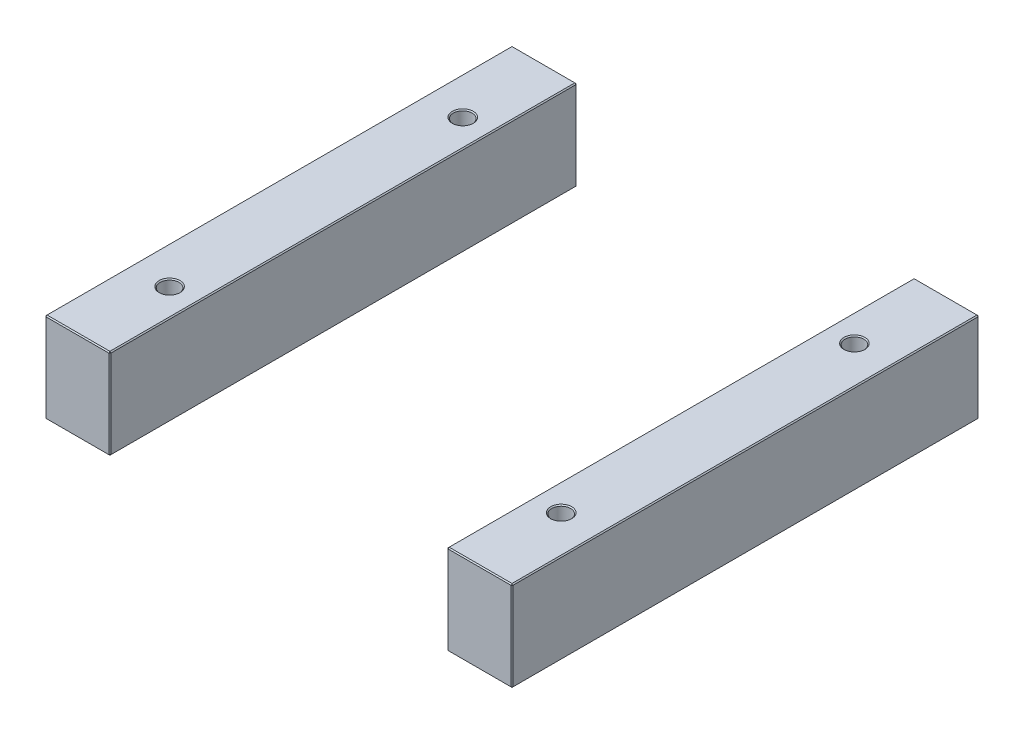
ISO-10303-21;
HEADER;
FILE_DESCRIPTION(('STEP AP214'),'2;1');
FILE_NAME('part.step','',(''),(''),'','','');
FILE_SCHEMA(('AUTOMOTIVE_DESIGN { 1 0 10303 214 1 1 1 1 }'));
ENDSEC;
DATA;
#1=APPLICATION_CONTEXT('core data for automotive mechanical design processes');
#2=APPLICATION_PROTOCOL_DEFINITION('international standard','automotive_design',2000,#1);
#3=PRODUCT_CONTEXT('',#1,'mechanical');
#4=PRODUCT('Part','Part','',(#3));
#5=PRODUCT_RELATED_PRODUCT_CATEGORY('part','',(#4));
#6=PRODUCT_DEFINITION_FORMATION('','',#4);
#7=PRODUCT_DEFINITION_CONTEXT('part definition',#1,'design');
#8=PRODUCT_DEFINITION('design','',#6,#7);
#9=PRODUCT_DEFINITION_SHAPE('','',#8);
#10=(LENGTH_UNIT() NAMED_UNIT(*) SI_UNIT(.MILLI.,.METRE.));
#11=(NAMED_UNIT(*) PLANE_ANGLE_UNIT() SI_UNIT($,.RADIAN.));
#12=(NAMED_UNIT(*) SI_UNIT($,.STERADIAN.) SOLID_ANGLE_UNIT());
#13=UNCERTAINTY_MEASURE_WITH_UNIT(LENGTH_MEASURE(1.E-05),#10,'distance_accuracy_value','');
#14=(GEOMETRIC_REPRESENTATION_CONTEXT(3) GLOBAL_UNCERTAINTY_ASSIGNED_CONTEXT((#13)) GLOBAL_UNIT_ASSIGNED_CONTEXT((#10,
#11,#12)) REPRESENTATION_CONTEXT('',''));
#15=CARTESIAN_POINT('',(0.,0.,0.));
#16=DIRECTION('',(0.,0.,1.));
#17=DIRECTION('',(1.,0.,0.));
#18=AXIS2_PLACEMENT_3D('',#15,#16,#17);
#19=CARTESIAN_POINT('',(-223.,86.,-223.));
#20=DIRECTION('',(0.,0.,1.));
#21=DIRECTION('',(1.,0.,0.));
#22=AXIS2_PLACEMENT_3D('',#19,#20,#21);
#23=PLANE('',#22);
#24=DIRECTION('',(-1.,0.,0.));
#25=VECTOR('',#24,1.);
#26=CARTESIAN_POINT('',(-223.,1.00000000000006,-223.));
#27=LINE('',#26,#25);
#28=CARTESIAN_POINT('',(-162.,1.00000000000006,-223.));
#29=VERTEX_POINT('',#28);
#30=CARTESIAN_POINT('',(-222.,1.00000000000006,-223.));
#31=VERTEX_POINT('',#30);
#32=EDGE_CURVE('P0_E137',#29,#31,#27,.T.);
#33=ORIENTED_EDGE('',*,*,#32,.T.);
#34=DIRECTION('',(0.,1.,0.));
#35=VECTOR('',#34,1.);
#36=CARTESIAN_POINT('',(-222.,86.,-223.));
#37=LINE('',#36,#35);
#38=CARTESIAN_POINT('',(-222.,85.,-223.));
#39=VERTEX_POINT('',#38);
#40=EDGE_CURVE('P0_E235',#31,#39,#37,.T.);
#41=ORIENTED_EDGE('',*,*,#40,.T.);
#42=DIRECTION('',(1.,0.,0.));
#43=VECTOR('',#42,1.);
#44=CARTESIAN_POINT('',(-223.,85.,-223.));
#45=LINE('',#44,#43);
#46=CARTESIAN_POINT('',(-162.,85.,-223.));
#47=VERTEX_POINT('',#46);
#48=EDGE_CURVE('P0_E233',#39,#47,#45,.T.);
#49=ORIENTED_EDGE('',*,*,#48,.T.);
#50=DIRECTION('',(0.,-1.,0.));
#51=VECTOR('',#50,1.);
#52=CARTESIAN_POINT('',(-162.,86.,-223.));
#53=LINE('',#52,#51);
#54=EDGE_CURVE('P0_E230',#47,#29,#53,.T.);
#55=ORIENTED_EDGE('',*,*,#54,.T.);
#56=EDGE_LOOP('',(#33,#41,#49,#55));
#57=FACE_BOUND('',#56,.T.);
#58=ADVANCED_FACE('P0_F16',(#57),#23,.F.);
#59=CARTESIAN_POINT('',(-223.,86.,223.));
#60=DIRECTION('',(1.,0.,0.));
#61=DIRECTION('',(0.,0.,-1.));
#62=AXIS2_PLACEMENT_3D('',#59,#60,#61);
#63=PLANE('',#62);
#64=DIRECTION('',(0.,1.,0.));
#65=VECTOR('',#64,1.);
#66=CARTESIAN_POINT('',(-223.,86.,222.));
#67=LINE('',#66,#65);
#68=CARTESIAN_POINT('',(-223.,1.00000000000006,222.));
#69=VERTEX_POINT('',#68);
#70=CARTESIAN_POINT('',(-223.,85.,222.));
#71=VERTEX_POINT('',#70);
#72=EDGE_CURVE('P0_E217',#69,#71,#67,.T.);
#73=ORIENTED_EDGE('',*,*,#72,.T.);
#74=DIRECTION('',(0.,0.,-1.));
#75=VECTOR('',#74,1.);
#76=CARTESIAN_POINT('',(-223.,85.,223.));
#77=LINE('',#76,#75);
#78=CARTESIAN_POINT('',(-223.,85.,-222.));
#79=VERTEX_POINT('',#78);
#80=EDGE_CURVE('P0_E228',#71,#79,#77,.T.);
#81=ORIENTED_EDGE('',*,*,#80,.T.);
#82=DIRECTION('',(0.,-1.,0.));
#83=VECTOR('',#82,1.);
#84=CARTESIAN_POINT('',(-223.,86.,-222.));
#85=LINE('',#84,#83);
#86=CARTESIAN_POINT('',(-223.,1.00000000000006,-222.));
#87=VERTEX_POINT('',#86);
#88=EDGE_CURVE('P0_E225',#79,#87,#85,.T.);
#89=ORIENTED_EDGE('',*,*,#88,.T.);
#90=DIRECTION('',(0.,0.,1.));
#91=VECTOR('',#90,1.);
#92=CARTESIAN_POINT('',(-223.,1.00000000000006,223.));
#93=LINE('',#92,#91);
#94=EDGE_CURVE('P0_E214',#87,#69,#93,.T.);
#95=ORIENTED_EDGE('',*,*,#94,.T.);
#96=EDGE_LOOP('',(#73,#81,#89,#95));
#97=FACE_BOUND('',#96,.T.);
#98=ADVANCED_FACE('P0_F302',(#97),#63,.F.);
#99=CARTESIAN_POINT('',(-223.,86.,223.));
#100=DIRECTION('',(0.,0.,-1.));
#101=DIRECTION('',(-1.,0.,0.));
#102=AXIS2_PLACEMENT_3D('',#99,#100,#101);
#103=PLANE('',#102);
#104=DIRECTION('',(-1.,0.,0.));
#105=VECTOR('',#104,1.);
#106=CARTESIAN_POINT('',(-223.,85.,223.));
#107=LINE('',#106,#105);
#108=CARTESIAN_POINT('',(-162.,85.,223.));
#109=VERTEX_POINT('',#108);
#110=CARTESIAN_POINT('',(-222.,85.,223.));
#111=VERTEX_POINT('',#110);
#112=EDGE_CURVE('P0_E242',#109,#111,#107,.T.);
#113=ORIENTED_EDGE('',*,*,#112,.T.);
#114=DIRECTION('',(0.,-1.,0.));
#115=VECTOR('',#114,1.);
#116=CARTESIAN_POINT('',(-222.,86.,223.));
#117=LINE('',#116,#115);
#118=CARTESIAN_POINT('',(-222.,1.00000000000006,223.));
#119=VERTEX_POINT('',#118);
#120=EDGE_CURVE('P0_E244',#111,#119,#117,.T.);
#121=ORIENTED_EDGE('',*,*,#120,.T.);
#122=DIRECTION('',(1.,0.,0.));
#123=VECTOR('',#122,1.);
#124=CARTESIAN_POINT('',(-161.,1.00000000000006,223.));
#125=LINE('',#124,#123);
#126=CARTESIAN_POINT('',(-162.,1.00000000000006,223.));
#127=VERTEX_POINT('',#126);
#128=EDGE_CURVE('P0_E240',#119,#127,#125,.T.);
#129=ORIENTED_EDGE('',*,*,#128,.T.);
#130=DIRECTION('',(0.,1.,0.));
#131=VECTOR('',#130,1.);
#132=CARTESIAN_POINT('',(-162.,86.,223.));
#133=LINE('',#132,#131);
#134=EDGE_CURVE('P0_E238',#127,#109,#133,.T.);
#135=ORIENTED_EDGE('',*,*,#134,.T.);
#136=EDGE_LOOP('',(#113,#121,#129,#135));
#137=FACE_BOUND('',#136,.T.);
#138=ADVANCED_FACE('P0_F341',(#137),#103,.F.);
#139=CARTESIAN_POINT('',(-161.,86.,-223.));
#140=DIRECTION('',(-1.,0.,0.));
#141=DIRECTION('',(0.,0.,1.));
#142=AXIS2_PLACEMENT_3D('',#139,#140,#141);
#143=PLANE('',#142);
#144=DIRECTION('',(0.,0.,1.));
#145=VECTOR('',#144,1.);
#146=CARTESIAN_POINT('',(-161.,85.,-223.));
#147=LINE('',#146,#145);
#148=CARTESIAN_POINT('',(-161.,85.,-222.));
#149=VERTEX_POINT('',#148);
#150=CARTESIAN_POINT('',(-161.,85.,222.));
#151=VERTEX_POINT('',#150);
#152=EDGE_CURVE('P0_E31',#149,#151,#147,.T.);
#153=ORIENTED_EDGE('',*,*,#152,.T.);
#154=DIRECTION('',(0.,-1.,0.));
#155=VECTOR('',#154,1.);
#156=CARTESIAN_POINT('',(-161.,86.,222.));
#157=LINE('',#156,#155);
#158=CARTESIAN_POINT('',(-161.,1.00000000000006,222.));
#159=VERTEX_POINT('',#158);
#160=EDGE_CURVE('P0_E190',#151,#159,#157,.T.);
#161=ORIENTED_EDGE('',*,*,#160,.T.);
#162=DIRECTION('',(0.,0.,-1.));
#163=VECTOR('',#162,1.);
#164=CARTESIAN_POINT('',(-161.,1.00000000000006,-223.));
#165=LINE('',#164,#163);
#166=CARTESIAN_POINT('',(-161.,1.00000000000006,-222.));
#167=VERTEX_POINT('',#166);
#168=EDGE_CURVE('P0_E256',#159,#167,#165,.T.);
#169=ORIENTED_EDGE('',*,*,#168,.T.);
#170=DIRECTION('',(0.,1.,0.));
#171=VECTOR('',#170,1.);
#172=CARTESIAN_POINT('',(-161.,86.,-222.));
#173=LINE('',#172,#171);
#174=EDGE_CURVE('P0_E36',#167,#149,#173,.T.);
#175=ORIENTED_EDGE('',*,*,#174,.T.);
#176=EDGE_LOOP('',(#153,#161,#169,#175));
#177=FACE_BOUND('',#176,.T.);
#178=ADVANCED_FACE('P0_F535',(#177),#143,.F.);
#179=CARTESIAN_POINT('',(0.,86.,0.));
#180=DIRECTION('',(0.,-1.,0.));
#181=DIRECTION('',(0.,0.,-1.));
#182=AXIS2_PLACEMENT_3D('',#179,#180,#181);
#183=PLANE('',#182);
#184=CARTESIAN_POINT('',(-187.,86.,140.));
#185=DIRECTION('',(0.,-1.,0.));
#186=DIRECTION('',(0.,0.,-1.));
#187=AXIS2_PLACEMENT_3D('',#184,#185,#186);
#188=CIRCLE('',#187,10.);
#189=CARTESIAN_POINT('',(-187.,86.,130.));
#190=VERTEX_POINT('',#189);
#191=EDGE_CURVE('P0_E24',#190,#190,#188,.T.);
#192=ORIENTED_EDGE('',*,*,#191,.T.);
#193=EDGE_LOOP('',(#192));
#194=FACE_BOUND('',#193,.T.);
#195=CARTESIAN_POINT('',(-187.,86.,-140.));
#196=DIRECTION('',(0.,-1.,0.));
#197=DIRECTION('',(0.,0.,-1.));
#198=AXIS2_PLACEMENT_3D('',#195,#196,#197);
#199=CIRCLE('',#198,10.);
#200=CARTESIAN_POINT('',(-187.,86.,-150.));
#201=VERTEX_POINT('',#200);
#202=EDGE_CURVE('P0_E189',#201,#201,#199,.T.);
#203=ORIENTED_EDGE('',*,*,#202,.T.);
#204=EDGE_LOOP('',(#203));
#205=FACE_BOUND('',#204,.T.);
#206=DIRECTION('',(0.,0.,1.));
#207=VECTOR('',#206,1.);
#208=CARTESIAN_POINT('',(-222.,86.,0.));
#209=LINE('',#208,#207);
#210=CARTESIAN_POINT('',(-222.,86.,-222.));
#211=VERTEX_POINT('',#210);
#212=CARTESIAN_POINT('',(-222.,86.,222.));
#213=VERTEX_POINT('',#212);
#214=EDGE_CURVE('P0_E251',#211,#213,#209,.T.);
#215=ORIENTED_EDGE('',*,*,#214,.T.);
#216=DIRECTION('',(1.,0.,0.));
#217=VECTOR('',#216,1.);
#218=CARTESIAN_POINT('',(0.,86.,222.));
#219=LINE('',#218,#217);
#220=CARTESIAN_POINT('',(-162.,86.,222.));
#221=VERTEX_POINT('',#220);
#222=EDGE_CURVE('P0_E253',#213,#221,#219,.T.);
#223=ORIENTED_EDGE('',*,*,#222,.T.);
#224=DIRECTION('',(0.,0.,-1.));
#225=VECTOR('',#224,1.);
#226=CARTESIAN_POINT('',(-162.,86.,0.));
#227=LINE('',#226,#225);
#228=CARTESIAN_POINT('',(-162.,86.,-222.));
#229=VERTEX_POINT('',#228);
#230=EDGE_CURVE('P0_E247',#221,#229,#227,.T.);
#231=ORIENTED_EDGE('',*,*,#230,.T.);
#232=DIRECTION('',(-1.,0.,0.));
#233=VECTOR('',#232,1.);
#234=CARTESIAN_POINT('',(0.,86.,-222.));
#235=LINE('',#234,#233);
#236=EDGE_CURVE('P0_E249',#229,#211,#235,.T.);
#237=ORIENTED_EDGE('',*,*,#236,.T.);
#238=EDGE_LOOP('',(#215,#223,#231,#237));
#239=FACE_BOUND('',#238,.T.);
#240=ADVANCED_FACE('P0_F195',(#194,#205,#239),#183,.F.);
#241=CARTESIAN_POINT('',(0.,0.,0.));
#242=DIRECTION('',(0.,-1.,0.));
#243=DIRECTION('',(0.,0.,-1.));
#244=AXIS2_PLACEMENT_3D('',#241,#242,#243);
#245=PLANE('',#244);
#246=CARTESIAN_POINT('',(-187.,0.,-140.));
#247=DIRECTION('',(0.,-1.,0.));
#248=DIRECTION('',(0.,0.,-1.));
#249=AXIS2_PLACEMENT_3D('',#246,#247,#248);
#250=CIRCLE('',#249,10.);
#251=CARTESIAN_POINT('',(-187.,0.,-150.));
#252=VERTEX_POINT('',#251);
#253=EDGE_CURVE('P0_E220',#252,#252,#250,.F.);
#254=ORIENTED_EDGE('',*,*,#253,.T.);
#255=EDGE_LOOP('',(#254));
#256=FACE_BOUND('',#255,.T.);
#257=CARTESIAN_POINT('',(-187.,0.,140.));
#258=DIRECTION('',(0.,-1.,0.));
#259=DIRECTION('',(0.,0.,-1.));
#260=AXIS2_PLACEMENT_3D('',#257,#258,#259);
#261=CIRCLE('',#260,10.);
#262=CARTESIAN_POINT('',(-187.,0.,130.));
#263=VERTEX_POINT('',#262);
#264=EDGE_CURVE('P0_E608',#263,#263,#261,.F.);
#265=ORIENTED_EDGE('',*,*,#264,.T.);
#266=EDGE_LOOP('',(#265));
#267=FACE_BOUND('',#266,.T.);
#268=DIRECTION('',(-1.,0.,0.));
#269=VECTOR('',#268,1.);
#270=CARTESIAN_POINT('',(-223.,0.,222.));
#271=LINE('',#270,#269);
#272=CARTESIAN_POINT('',(-162.,0.,222.));
#273=VERTEX_POINT('',#272);
#274=CARTESIAN_POINT('',(-222.,0.,222.));
#275=VERTEX_POINT('',#274);
#276=EDGE_CURVE('P0_E114',#273,#275,#271,.T.);
#277=ORIENTED_EDGE('',*,*,#276,.T.);
#278=DIRECTION('',(0.,0.,-1.));
#279=VECTOR('',#278,1.);
#280=CARTESIAN_POINT('',(-222.,0.,-223.));
#281=LINE('',#280,#279);
#282=CARTESIAN_POINT('',(-222.,0.,-222.));
#283=VERTEX_POINT('',#282);
#284=EDGE_CURVE('P0_E110',#275,#283,#281,.T.);
#285=ORIENTED_EDGE('',*,*,#284,.T.);
#286=DIRECTION('',(1.,0.,0.));
#287=VECTOR('',#286,1.);
#288=CARTESIAN_POINT('',(-161.,0.,-222.));
#289=LINE('',#288,#287);
#290=CARTESIAN_POINT('',(-162.,0.,-222.));
#291=VERTEX_POINT('',#290);
#292=EDGE_CURVE('P0_E104',#283,#291,#289,.T.);
#293=ORIENTED_EDGE('',*,*,#292,.T.);
#294=DIRECTION('',(0.,0.,1.));
#295=VECTOR('',#294,1.);
#296=CARTESIAN_POINT('',(-162.,0.,223.));
#297=LINE('',#296,#295);
#298=EDGE_CURVE('P0_E107',#291,#273,#297,.T.);
#299=ORIENTED_EDGE('',*,*,#298,.T.);
#300=EDGE_LOOP('',(#277,#285,#293,#299));
#301=FACE_BOUND('',#300,.T.);
#302=ADVANCED_FACE('P0_F106',(#256,#267,#301),#245,.T.);
#303=CARTESIAN_POINT('',(-187.,0.,-140.));
#304=DIRECTION('',(0.,1.,0.));
#305=DIRECTION('',(0.,0.,1.));
#306=AXIS2_PLACEMENT_3D('',#303,#304,#305);
#307=CYLINDRICAL_SURFACE('',#306,9.);
#308=CARTESIAN_POINT('',(-187.,85.,-140.));
#309=DIRECTION('',(0.,-1.,0.));
#310=DIRECTION('',(0.,0.,-1.));
#311=AXIS2_PLACEMENT_3D('',#308,#309,#310);
#312=CIRCLE('',#311,9.);
#313=CARTESIAN_POINT('',(-187.,85.,-149.));
#314=VERTEX_POINT('',#313);
#315=EDGE_CURVE('P0_E10',#314,#314,#312,.F.);
#316=ORIENTED_EDGE('',*,*,#315,.T.);
#317=EDGE_LOOP('',(#316));
#318=FACE_BOUND('',#317,.T.);
#319=CARTESIAN_POINT('',(-187.,1.00000000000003,-140.));
#320=DIRECTION('',(0.,-1.,0.));
#321=DIRECTION('',(0.,0.,-1.));
#322=AXIS2_PLACEMENT_3D('',#319,#320,#321);
#323=CIRCLE('',#322,9.);
#324=CARTESIAN_POINT('',(-187.,1.00000000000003,-149.));
#325=VERTEX_POINT('',#324);
#326=EDGE_CURVE('P0_E215',#325,#325,#323,.T.);
#327=ORIENTED_EDGE('',*,*,#326,.T.);
#328=EDGE_LOOP('',(#327));
#329=FACE_BOUND('',#328,.T.);
#330=ADVANCED_FACE('P0_F208',(#318,#329),#307,.F.);
#331=CARTESIAN_POINT('',(-187.,0.,140.));
#332=DIRECTION('',(0.,1.,0.));
#333=DIRECTION('',(0.,0.,1.));
#334=AXIS2_PLACEMENT_3D('',#331,#332,#333);
#335=CYLINDRICAL_SURFACE('',#334,9.);
#336=CARTESIAN_POINT('',(-187.,85.,140.));
#337=DIRECTION('',(0.,-1.,0.));
#338=DIRECTION('',(0.,0.,-1.));
#339=AXIS2_PLACEMENT_3D('',#336,#337,#338);
#340=CIRCLE('',#339,9.);
#341=CARTESIAN_POINT('',(-187.,85.,131.));
#342=VERTEX_POINT('',#341);
#343=EDGE_CURVE('P0_E186',#342,#342,#340,.F.);
#344=ORIENTED_EDGE('',*,*,#343,.T.);
#345=EDGE_LOOP('',(#344));
#346=FACE_BOUND('',#345,.T.);
#347=CARTESIAN_POINT('',(-187.,1.00000000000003,140.));
#348=DIRECTION('',(0.,-1.,0.));
#349=DIRECTION('',(0.,0.,-1.));
#350=AXIS2_PLACEMENT_3D('',#347,#348,#349);
#351=CIRCLE('',#350,9.);
#352=CARTESIAN_POINT('',(-187.,1.00000000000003,131.));
#353=VERTEX_POINT('',#352);
#354=EDGE_CURVE('P0_E212',#353,#353,#351,.T.);
#355=ORIENTED_EDGE('',*,*,#354,.T.);
#356=EDGE_LOOP('',(#355));
#357=FACE_BOUND('',#356,.T.);
#358=ADVANCED_FACE('P0_F204',(#346,#357),#335,.F.);
#359=CARTESIAN_POINT('',(-187.,0.,-140.));
#360=DIRECTION('',(0.,-1.,0.));
#361=DIRECTION('',(0.,0.,-1.));
#362=AXIS2_PLACEMENT_3D('',#359,#360,#361);
#363=CONICAL_SURFACE('',#362,10.,0.785398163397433);
#364=ORIENTED_EDGE('',*,*,#326,.F.);
#365=EDGE_LOOP('',(#364));
#366=FACE_BOUND('',#365,.T.);
#367=ORIENTED_EDGE('',*,*,#253,.F.);
#368=EDGE_LOOP('',(#367));
#369=FACE_BOUND('',#368,.T.);
#370=ADVANCED_FACE('P0_F207',(#366,#369),#363,.F.);
#371=CARTESIAN_POINT('',(-187.,0.,140.));
#372=DIRECTION('',(0.,-1.,0.));
#373=DIRECTION('',(0.,0.,-1.));
#374=AXIS2_PLACEMENT_3D('',#371,#372,#373);
#375=CONICAL_SURFACE('',#374,10.,0.785398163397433);
#376=ORIENTED_EDGE('',*,*,#354,.F.);
#377=EDGE_LOOP('',(#376));
#378=FACE_BOUND('',#377,.T.);
#379=ORIENTED_EDGE('',*,*,#264,.F.);
#380=EDGE_LOOP('',(#379));
#381=FACE_BOUND('',#380,.T.);
#382=ADVANCED_FACE('P0_F347',(#378,#381),#375,.F.);
#383=CARTESIAN_POINT('',(-161.,86.,222.));
#384=DIRECTION('',(-0.707106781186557,0.,-0.707106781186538));
#385=DIRECTION('',(0.,-1.,0.));
#386=AXIS2_PLACEMENT_3D('',#383,#384,#385);
#387=PLANE('',#386);
#388=DIRECTION('',(-0.707106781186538,0.,0.707106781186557));
#389=VECTOR('',#388,1.);
#390=CARTESIAN_POINT('',(-161.5,85.,222.5));
#391=LINE('',#390,#389);
#392=EDGE_CURVE('P0_E125',#109,#151,#391,.F.);
#393=ORIENTED_EDGE('',*,*,#392,.F.);
#394=ORIENTED_EDGE('',*,*,#134,.F.);
#395=DIRECTION('',(0.707106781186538,0.,-0.707106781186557));
#396=VECTOR('',#395,1.);
#397=CARTESIAN_POINT('',(-162.,1.00000000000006,223.));
#398=LINE('',#397,#396);
#399=EDGE_CURVE('P0_E181',#159,#127,#398,.F.);
#400=ORIENTED_EDGE('',*,*,#399,.F.);
#401=ORIENTED_EDGE('',*,*,#160,.F.);
#402=EDGE_LOOP('',(#393,#394,#400,#401));
#403=FACE_BOUND('',#402,.T.);
#404=ADVANCED_FACE('P0_F351',(#403),#387,.F.);
#405=CARTESIAN_POINT('',(-162.,86.,222.));
#406=DIRECTION('',(0.577350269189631,0.577350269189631,0.577350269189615));
#407=DIRECTION('',(-0.707106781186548,0.707106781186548,0.));
#408=AXIS2_PLACEMENT_3D('',#405,#406,#407);
#409=PLANE('',#408);
#410=DIRECTION('',(0.,0.707106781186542,-0.707106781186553));
#411=VECTOR('',#410,1.);
#412=CARTESIAN_POINT('',(-162.,86.,222.));
#413=LINE('',#412,#411);
#414=EDGE_CURVE('P0_E175',#109,#221,#413,.T.);
#415=ORIENTED_EDGE('',*,*,#414,.F.);
#416=ORIENTED_EDGE('',*,*,#392,.T.);
#417=DIRECTION('',(0.707106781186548,-0.707106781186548,0.));
#418=VECTOR('',#417,1.);
#419=CARTESIAN_POINT('',(-162.,86.,222.));
#420=LINE('',#419,#418);
#421=EDGE_CURVE('P0_E178',#221,#151,#420,.T.);
#422=ORIENTED_EDGE('',*,*,#421,.F.);
#423=EDGE_LOOP('',(#415,#416,#422));
#424=FACE_BOUND('',#423,.T.);
#425=ADVANCED_FACE('P0_F487',(#424),#409,.T.);
#426=CARTESIAN_POINT('',(-162.,1.00000000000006,223.));
#427=DIRECTION('',(0.577350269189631,-0.577350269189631,0.577350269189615));
#428=DIRECTION('',(0.707106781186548,0.707106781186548,0.));
#429=AXIS2_PLACEMENT_3D('',#426,#427,#428);
#430=PLANE('',#429);
#431=DIRECTION('',(0.707106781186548,0.707106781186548,0.));
#432=VECTOR('',#431,1.);
#433=CARTESIAN_POINT('',(-161.5,0.500000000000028,222.));
#434=LINE('',#433,#432);
#435=EDGE_CURVE('P0_E123',#159,#273,#434,.F.);
#436=ORIENTED_EDGE('',*,*,#435,.F.);
#437=ORIENTED_EDGE('',*,*,#399,.T.);
#438=DIRECTION('',(0.,-0.707106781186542,-0.707106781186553));
#439=VECTOR('',#438,1.);
#440=CARTESIAN_POINT('',(-162.,1.00000000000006,223.));
#441=LINE('',#440,#439);
#442=EDGE_CURVE('P0_E172',#273,#127,#441,.F.);
#443=ORIENTED_EDGE('',*,*,#442,.F.);
#444=EDGE_LOOP('',(#436,#437,#443));
#445=FACE_BOUND('',#444,.T.);
#446=ADVANCED_FACE('P0_F478',(#445),#430,.T.);
#447=CARTESIAN_POINT('',(-162.,86.,0.));
#448=DIRECTION('',(-0.707106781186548,-0.707106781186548,0.));
#449=DIRECTION('',(0.,0.,-1.));
#450=AXIS2_PLACEMENT_3D('',#447,#448,#449);
#451=PLANE('',#450);
#452=ORIENTED_EDGE('',*,*,#421,.T.);
#453=ORIENTED_EDGE('',*,*,#152,.F.);
#454=DIRECTION('',(-0.707106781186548,0.707106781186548,0.));
#455=VECTOR('',#454,1.);
#456=CARTESIAN_POINT('',(-161.5,85.5,-222.));
#457=LINE('',#456,#455);
#458=EDGE_CURVE('P0_E165',#229,#149,#457,.F.);
#459=ORIENTED_EDGE('',*,*,#458,.F.);
#460=ORIENTED_EDGE('',*,*,#230,.F.);
#461=EDGE_LOOP('',(#452,#453,#459,#460));
#462=FACE_BOUND('',#461,.T.);
#463=ADVANCED_FACE('P0_F318',(#462),#451,.F.);
#464=CARTESIAN_POINT('',(0.,86.,222.));
#465=DIRECTION('',(0.,-0.707106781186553,-0.707106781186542));
#466=DIRECTION('',(1.,0.,0.));
#467=AXIS2_PLACEMENT_3D('',#464,#465,#466);
#468=PLANE('',#467);
#469=ORIENTED_EDGE('',*,*,#414,.T.);
#470=ORIENTED_EDGE('',*,*,#222,.F.);
#471=DIRECTION('',(0.,-0.707106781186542,0.707106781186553));
#472=VECTOR('',#471,1.);
#473=CARTESIAN_POINT('',(-222.,85.5,222.5));
#474=LINE('',#473,#472);
#475=EDGE_CURVE('P0_E162',#111,#213,#474,.F.);
#476=ORIENTED_EDGE('',*,*,#475,.F.);
#477=ORIENTED_EDGE('',*,*,#112,.F.);
#478=EDGE_LOOP('',(#469,#470,#476,#477));
#479=FACE_BOUND('',#478,.T.);
#480=ADVANCED_FACE('P0_F313',(#479),#468,.F.);
#481=CARTESIAN_POINT('',(-222.,86.,223.));
#482=DIRECTION('',(0.707106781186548,0.,-0.707106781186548));
#483=DIRECTION('',(0.,-1.,0.));
#484=AXIS2_PLACEMENT_3D('',#481,#482,#483);
#485=PLANE('',#484);
#486=DIRECTION('',(0.707106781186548,0.,0.707106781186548));
#487=VECTOR('',#486,1.);
#488=CARTESIAN_POINT('',(-222.,1.00000000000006,223.));
#489=LINE('',#488,#487);
#490=EDGE_CURVE('P0_E156',#119,#69,#489,.F.);
#491=ORIENTED_EDGE('',*,*,#490,.F.);
#492=ORIENTED_EDGE('',*,*,#120,.F.);
#493=DIRECTION('',(-0.707106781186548,0.,-0.707106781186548));
#494=VECTOR('',#493,1.);
#495=CARTESIAN_POINT('',(-223.,85.,222.));
#496=LINE('',#495,#494);
#497=EDGE_CURVE('P0_E159',#71,#111,#496,.F.);
#498=ORIENTED_EDGE('',*,*,#497,.F.);
#499=ORIENTED_EDGE('',*,*,#72,.F.);
#500=EDGE_LOOP('',(#491,#492,#498,#499));
#501=FACE_BOUND('',#500,.T.);
#502=ADVANCED_FACE('P0_F307',(#501),#485,.F.);
#503=CARTESIAN_POINT('',(-223.,1.00000000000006,223.));
#504=DIRECTION('',(0.,-0.707106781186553,0.707106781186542));
#505=DIRECTION('',(-1.,0.,0.));
#506=AXIS2_PLACEMENT_3D('',#503,#504,#505);
#507=PLANE('',#506);
#508=ORIENTED_EDGE('',*,*,#442,.T.);
#509=ORIENTED_EDGE('',*,*,#128,.F.);
#510=DIRECTION('',(0.,0.707106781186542,0.707106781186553));
#511=VECTOR('',#510,1.);
#512=CARTESIAN_POINT('',(-222.,1.00000000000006,223.));
#513=LINE('',#512,#511);
#514=EDGE_CURVE('P0_E134',#275,#119,#513,.T.);
#515=ORIENTED_EDGE('',*,*,#514,.F.);
#516=ORIENTED_EDGE('',*,*,#276,.F.);
#517=EDGE_LOOP('',(#508,#509,#515,#516));
#518=FACE_BOUND('',#517,.T.);
#519=ADVANCED_FACE('P0_F333',(#518),#507,.T.);
#520=CARTESIAN_POINT('',(-161.,1.00000000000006,-223.));
#521=DIRECTION('',(0.707106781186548,-0.707106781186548,0.));
#522=DIRECTION('',(0.,0.,1.));
#523=AXIS2_PLACEMENT_3D('',#520,#521,#522);
#524=PLANE('',#523);
#525=ORIENTED_EDGE('',*,*,#435,.T.);
#526=ORIENTED_EDGE('',*,*,#298,.F.);
#527=DIRECTION('',(-0.707106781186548,-0.707106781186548,0.));
#528=VECTOR('',#527,1.);
#529=CARTESIAN_POINT('',(-162.,0.,-222.));
#530=LINE('',#529,#528);
#531=EDGE_CURVE('P0_E120',#167,#291,#530,.T.);
#532=ORIENTED_EDGE('',*,*,#531,.F.);
#533=ORIENTED_EDGE('',*,*,#168,.F.);
#534=EDGE_LOOP('',(#525,#526,#532,#533));
#535=FACE_BOUND('',#534,.T.);
#536=ADVANCED_FACE('P0_F119',(#535),#524,.T.);
#537=CARTESIAN_POINT('',(-162.,86.,-223.));
#538=DIRECTION('',(-0.707106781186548,0.,0.707106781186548));
#539=DIRECTION('',(0.,-1.,0.));
#540=AXIS2_PLACEMENT_3D('',#537,#538,#539);
#541=PLANE('',#540);
#542=DIRECTION('',(0.707106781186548,0.,0.707106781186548));
#543=VECTOR('',#542,1.);
#544=CARTESIAN_POINT('',(-162.,85.,-223.));
#545=LINE('',#544,#543);
#546=EDGE_CURVE('P0_E168',#149,#47,#545,.F.);
#547=ORIENTED_EDGE('',*,*,#546,.F.);
#548=ORIENTED_EDGE('',*,*,#174,.F.);
#549=DIRECTION('',(-0.707106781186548,0.,-0.707106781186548));
#550=VECTOR('',#549,1.);
#551=CARTESIAN_POINT('',(-161.5,1.00000000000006,-222.5));
#552=LINE('',#551,#550);
#553=EDGE_CURVE('P0_E133',#29,#167,#552,.F.);
#554=ORIENTED_EDGE('',*,*,#553,.F.);
#555=ORIENTED_EDGE('',*,*,#54,.F.);
#556=EDGE_LOOP('',(#547,#548,#554,#555));
#557=FACE_BOUND('',#556,.T.);
#558=ADVANCED_FACE('P0_F323',(#557),#541,.F.);
#559=CARTESIAN_POINT('',(-162.,85.,-223.));
#560=DIRECTION('',(0.577350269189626,0.577350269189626,-0.577350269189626));
#561=DIRECTION('',(-0.707106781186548,0.,-0.707106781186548));
#562=AXIS2_PLACEMENT_3D('',#559,#560,#561);
#563=PLANE('',#562);
#564=ORIENTED_EDGE('',*,*,#458,.T.);
#565=ORIENTED_EDGE('',*,*,#546,.T.);
#566=DIRECTION('',(0.,-0.707106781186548,-0.707106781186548));
#567=VECTOR('',#566,1.);
#568=CARTESIAN_POINT('',(-162.,85.,-223.));
#569=LINE('',#568,#567);
#570=EDGE_CURVE('P0_E151',#229,#47,#569,.T.);
#571=ORIENTED_EDGE('',*,*,#570,.F.);
#572=EDGE_LOOP('',(#564,#565,#571));
#573=FACE_BOUND('',#572,.T.);
#574=ADVANCED_FACE('P0_F321',(#573),#563,.T.);
#575=CARTESIAN_POINT('',(-223.,85.,222.));
#576=DIRECTION('',(-0.57735026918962,0.577350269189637,0.57735026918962));
#577=DIRECTION('',(0.,-0.707106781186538,0.707106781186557));
#578=AXIS2_PLACEMENT_3D('',#575,#576,#577);
#579=PLANE('',#578);
#580=ORIENTED_EDGE('',*,*,#497,.T.);
#581=ORIENTED_EDGE('',*,*,#475,.T.);
#582=DIRECTION('',(0.707106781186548,0.707106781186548,0.));
#583=VECTOR('',#582,1.);
#584=CARTESIAN_POINT('',(-223.,85.,222.));
#585=LINE('',#584,#583);
#586=EDGE_CURVE('P0_E142',#71,#213,#585,.T.);
#587=ORIENTED_EDGE('',*,*,#586,.F.);
#588=EDGE_LOOP('',(#580,#581,#587));
#589=FACE_BOUND('',#588,.T.);
#590=ADVANCED_FACE('P0_F310',(#589),#579,.T.);
#591=CARTESIAN_POINT('',(-222.,1.00000000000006,223.));
#592=DIRECTION('',(-0.57735026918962,-0.577350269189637,0.57735026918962));
#593=DIRECTION('',(0.,-0.707106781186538,-0.707106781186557));
#594=AXIS2_PLACEMENT_3D('',#591,#592,#593);
#595=PLANE('',#594);
#596=ORIENTED_EDGE('',*,*,#514,.T.);
#597=ORIENTED_EDGE('',*,*,#490,.T.);
#598=DIRECTION('',(0.707106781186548,-0.707106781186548,0.));
#599=VECTOR('',#598,1.);
#600=CARTESIAN_POINT('',(-222.5,0.500000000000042,222.));
#601=LINE('',#600,#599);
#602=EDGE_CURVE('P0_E138',#275,#69,#601,.F.);
#603=ORIENTED_EDGE('',*,*,#602,.F.);
#604=EDGE_LOOP('',(#596,#597,#603));
#605=FACE_BOUND('',#604,.T.);
#606=ADVANCED_FACE('P0_F368',(#605),#595,.T.);
#607=CARTESIAN_POINT('',(-162.,0.,-222.));
#608=DIRECTION('',(0.577350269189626,-0.577350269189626,-0.577350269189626));
#609=DIRECTION('',(-0.707106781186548,0.,-0.707106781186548));
#610=AXIS2_PLACEMENT_3D('',#607,#608,#609);
#611=PLANE('',#610);
#612=ORIENTED_EDGE('',*,*,#553,.T.);
#613=ORIENTED_EDGE('',*,*,#531,.T.);
#614=DIRECTION('',(0.,0.707106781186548,-0.707106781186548));
#615=VECTOR('',#614,1.);
#616=CARTESIAN_POINT('',(-162.,0.,-222.));
#617=LINE('',#616,#615);
#618=EDGE_CURVE('P0_E130',#29,#291,#617,.F.);
#619=ORIENTED_EDGE('',*,*,#618,.F.);
#620=EDGE_LOOP('',(#612,#613,#619));
#621=FACE_BOUND('',#620,.T.);
#622=ADVANCED_FACE('P0_F129',(#621),#611,.T.);
#623=CARTESIAN_POINT('',(0.,86.,-222.));
#624=DIRECTION('',(0.,-0.707106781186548,0.707106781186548));
#625=DIRECTION('',(-1.,0.,0.));
#626=AXIS2_PLACEMENT_3D('',#623,#624,#625);
#627=PLANE('',#626);
#628=ORIENTED_EDGE('',*,*,#570,.T.);
#629=ORIENTED_EDGE('',*,*,#48,.F.);
#630=DIRECTION('',(0.,0.707106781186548,0.707106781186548));
#631=VECTOR('',#630,1.);
#632=CARTESIAN_POINT('',(-222.,85.,-223.));
#633=LINE('',#632,#631);
#634=EDGE_CURVE('P0_E139',#211,#39,#633,.F.);
#635=ORIENTED_EDGE('',*,*,#634,.F.);
#636=ORIENTED_EDGE('',*,*,#236,.F.);
#637=EDGE_LOOP('',(#628,#629,#635,#636));
#638=FACE_BOUND('',#637,.T.);
#639=ADVANCED_FACE('P0_F286',(#638),#627,.F.);
#640=CARTESIAN_POINT('',(-222.,86.,0.));
#641=DIRECTION('',(0.707106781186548,-0.707106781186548,0.));
#642=DIRECTION('',(0.,0.,1.));
#643=AXIS2_PLACEMENT_3D('',#640,#641,#642);
#644=PLANE('',#643);
#645=ORIENTED_EDGE('',*,*,#586,.T.);
#646=ORIENTED_EDGE('',*,*,#214,.F.);
#647=DIRECTION('',(-0.707106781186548,-0.707106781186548,0.));
#648=VECTOR('',#647,1.);
#649=CARTESIAN_POINT('',(-222.5,85.5,-222.));
#650=LINE('',#649,#648);
#651=EDGE_CURVE('P0_E145',#79,#211,#650,.F.);
#652=ORIENTED_EDGE('',*,*,#651,.F.);
#653=ORIENTED_EDGE('',*,*,#80,.F.);
#654=EDGE_LOOP('',(#645,#646,#652,#653));
#655=FACE_BOUND('',#654,.T.);
#656=ADVANCED_FACE('P0_F280',(#655),#644,.F.);
#657=CARTESIAN_POINT('',(-223.,1.00000000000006,223.));
#658=DIRECTION('',(-0.707106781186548,-0.707106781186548,0.));
#659=DIRECTION('',(0.,0.,-1.));
#660=AXIS2_PLACEMENT_3D('',#657,#658,#659);
#661=PLANE('',#660);
#662=ORIENTED_EDGE('',*,*,#602,.T.);
#663=ORIENTED_EDGE('',*,*,#94,.F.);
#664=DIRECTION('',(-0.707106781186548,0.707106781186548,0.));
#665=VECTOR('',#664,1.);
#666=CARTESIAN_POINT('',(-223.,1.00000000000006,-222.));
#667=LINE('',#666,#665);
#668=EDGE_CURVE('P0_E267',#283,#87,#667,.T.);
#669=ORIENTED_EDGE('',*,*,#668,.F.);
#670=ORIENTED_EDGE('',*,*,#284,.F.);
#671=EDGE_LOOP('',(#662,#663,#669,#670));
#672=FACE_BOUND('',#671,.T.);
#673=ADVANCED_FACE('P0_F298',(#672),#661,.T.);
#674=CARTESIAN_POINT('',(-223.,1.00000000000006,-223.));
#675=DIRECTION('',(0.,-0.707106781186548,-0.707106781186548));
#676=DIRECTION('',(1.,0.,0.));
#677=AXIS2_PLACEMENT_3D('',#674,#675,#676);
#678=PLANE('',#677);
#679=ORIENTED_EDGE('',*,*,#618,.T.);
#680=ORIENTED_EDGE('',*,*,#292,.F.);
#681=DIRECTION('',(0.,-0.707106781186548,0.707106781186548));
#682=VECTOR('',#681,1.);
#683=CARTESIAN_POINT('',(-222.,0.500000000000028,-222.5));
#684=LINE('',#683,#682);
#685=EDGE_CURVE('P0_E265',#31,#283,#684,.T.);
#686=ORIENTED_EDGE('',*,*,#685,.F.);
#687=ORIENTED_EDGE('',*,*,#32,.F.);
#688=EDGE_LOOP('',(#679,#680,#686,#687));
#689=FACE_BOUND('',#688,.T.);
#690=ADVANCED_FACE('P0_F136',(#689),#678,.T.);
#691=CARTESIAN_POINT('',(-222.,85.,-223.));
#692=DIRECTION('',(-0.577350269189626,0.577350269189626,-0.577350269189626));
#693=DIRECTION('',(-0.707106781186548,0.,0.707106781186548));
#694=AXIS2_PLACEMENT_3D('',#691,#692,#693);
#695=PLANE('',#694);
#696=ORIENTED_EDGE('',*,*,#651,.T.);
#697=ORIENTED_EDGE('',*,*,#634,.T.);
#698=DIRECTION('',(0.707106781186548,0.,-0.707106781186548));
#699=VECTOR('',#698,1.);
#700=CARTESIAN_POINT('',(-222.,85.,-223.));
#701=LINE('',#700,#699);
#702=EDGE_CURVE('P0_E263',#79,#39,#701,.T.);
#703=ORIENTED_EDGE('',*,*,#702,.F.);
#704=EDGE_LOOP('',(#696,#697,#703));
#705=FACE_BOUND('',#704,.T.);
#706=ADVANCED_FACE('P0_F273',(#705),#695,.T.);
#707=CARTESIAN_POINT('',(-223.,1.00000000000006,-222.));
#708=DIRECTION('',(-0.577350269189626,-0.577350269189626,-0.577350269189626));
#709=DIRECTION('',(-0.707106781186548,0.,0.707106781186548));
#710=AXIS2_PLACEMENT_3D('',#707,#708,#709);
#711=PLANE('',#710);
#712=ORIENTED_EDGE('',*,*,#685,.T.);
#713=ORIENTED_EDGE('',*,*,#668,.T.);
#714=DIRECTION('',(-0.707106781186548,0.,0.707106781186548));
#715=VECTOR('',#714,1.);
#716=CARTESIAN_POINT('',(-223.,1.00000000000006,-222.));
#717=LINE('',#716,#715);
#718=EDGE_CURVE('P0_E261',#31,#87,#717,.T.);
#719=ORIENTED_EDGE('',*,*,#718,.F.);
#720=EDGE_LOOP('',(#712,#713,#719));
#721=FACE_BOUND('',#720,.T.);
#722=ADVANCED_FACE('P0_F294',(#721),#711,.T.);
#723=CARTESIAN_POINT('',(-223.,86.,-222.));
#724=DIRECTION('',(0.707106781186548,0.,0.707106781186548));
#725=DIRECTION('',(0.,-1.,0.));
#726=AXIS2_PLACEMENT_3D('',#723,#724,#725);
#727=PLANE('',#726);
#728=ORIENTED_EDGE('',*,*,#702,.T.);
#729=ORIENTED_EDGE('',*,*,#40,.F.);
#730=ORIENTED_EDGE('',*,*,#718,.T.);
#731=ORIENTED_EDGE('',*,*,#88,.F.);
#732=EDGE_LOOP('',(#728,#729,#730,#731));
#733=FACE_BOUND('',#732,.T.);
#734=ADVANCED_FACE('P0_F201',(#733),#727,.F.);
#735=CARTESIAN_POINT('',(-187.,85.,140.));
#736=DIRECTION('',(0.,1.,0.));
#737=DIRECTION('',(0.,0.,1.));
#738=AXIS2_PLACEMENT_3D('',#735,#736,#737);
#739=CONICAL_SURFACE('',#738,9.,0.785398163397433);
#740=ORIENTED_EDGE('',*,*,#191,.F.);
#741=EDGE_LOOP('',(#740));
#742=FACE_BOUND('',#741,.T.);
#743=ORIENTED_EDGE('',*,*,#343,.F.);
#744=EDGE_LOOP('',(#743));
#745=FACE_BOUND('',#744,.T.);
#746=ADVANCED_FACE('P0_F198',(#742,#745),#739,.F.);
#747=CARTESIAN_POINT('',(-187.,85.,-140.));
#748=DIRECTION('',(0.,1.,0.));
#749=DIRECTION('',(0.,0.,1.));
#750=AXIS2_PLACEMENT_3D('',#747,#748,#749);
#751=CONICAL_SURFACE('',#750,9.,0.785398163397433);
#752=ORIENTED_EDGE('',*,*,#202,.F.);
#753=EDGE_LOOP('',(#752));
#754=FACE_BOUND('',#753,.T.);
#755=ORIENTED_EDGE('',*,*,#315,.F.);
#756=EDGE_LOOP('',(#755));
#757=FACE_BOUND('',#756,.T.);
#758=ADVANCED_FACE('P0_F18',(#754,#757),#751,.F.);
#759=CLOSED_SHELL('',(#58,#98,#138,#178,#240,#302,#330,#358,#370,#382,#404,#425,#446,#463,#480,
#502,#519,#536,#558,#574,#590,#606,#622,#639,#656,#673,#690,#706,#722,#734,#746,#758));
#760=MANIFOLD_SOLID_BREP('P0_B1',#759);
#761=CARTESIAN_POINT('',(223.,86.,223.));
#762=DIRECTION('',(0.,0.,-1.));
#763=DIRECTION('',(-1.,0.,0.));
#764=AXIS2_PLACEMENT_3D('',#761,#762,#763);
#765=PLANE('',#764);
#766=DIRECTION('',(0.,-1.,0.));
#767=VECTOR('',#766,1.);
#768=CARTESIAN_POINT('',(162.,86.,223.));
#769=LINE('',#768,#767);
#770=CARTESIAN_POINT('',(162.,85.,223.));
#771=VERTEX_POINT('',#770);
#772=CARTESIAN_POINT('',(162.,1.,223.));
#773=VERTEX_POINT('',#772);
#774=EDGE_CURVE('P1_E174',#771,#773,#769,.T.);
#775=ORIENTED_EDGE('',*,*,#774,.T.);
#776=DIRECTION('',(1.,0.,0.));
#777=VECTOR('',#776,1.);
#778=CARTESIAN_POINT('',(223.,1.,223.));
#779=LINE('',#778,#777);
#780=CARTESIAN_POINT('',(222.,1.,223.));
#781=VERTEX_POINT('',#780);
#782=EDGE_CURVE('P1_E176',#773,#781,#779,.T.);
#783=ORIENTED_EDGE('',*,*,#782,.T.);
#784=DIRECTION('',(0.,1.,0.));
#785=VECTOR('',#784,1.);
#786=CARTESIAN_POINT('',(222.,86.,223.));
#787=LINE('',#786,#785);
#788=CARTESIAN_POINT('',(222.,85.,223.));
#789=VERTEX_POINT('',#788);
#790=EDGE_CURVE('P1_E172',#781,#789,#787,.T.);
#791=ORIENTED_EDGE('',*,*,#790,.T.);
#792=DIRECTION('',(-1.,0.,0.));
#793=VECTOR('',#792,1.);
#794=CARTESIAN_POINT('',(161.,85.,223.));
#795=LINE('',#794,#793);
#796=EDGE_CURVE('P1_E170',#789,#771,#795,.T.);
#797=ORIENTED_EDGE('',*,*,#796,.T.);
#798=EDGE_LOOP('',(#775,#783,#791,#797));
#799=FACE_BOUND('',#798,.T.);
#800=ADVANCED_FACE('P1_F17',(#799),#765,.F.);
#801=CARTESIAN_POINT('',(223.,86.,223.));
#802=DIRECTION('',(-1.,0.,0.));
#803=DIRECTION('',(0.,0.,1.));
#804=AXIS2_PLACEMENT_3D('',#801,#802,#803);
#805=PLANE('',#804);
#806=DIRECTION('',(0.,0.,1.));
#807=VECTOR('',#806,1.);
#808=CARTESIAN_POINT('',(223.,85.,223.));
#809=LINE('',#808,#807);
#810=CARTESIAN_POINT('',(223.,85.,-222.));
#811=VERTEX_POINT('',#810);
#812=CARTESIAN_POINT('',(223.,85.,222.));
#813=VERTEX_POINT('',#812);
#814=EDGE_CURVE('P1_E188',#811,#813,#809,.T.);
#815=ORIENTED_EDGE('',*,*,#814,.T.);
#816=DIRECTION('',(0.,-1.,0.));
#817=VECTOR('',#816,1.);
#818=CARTESIAN_POINT('',(223.,86.,222.));
#819=LINE('',#818,#817);
#820=CARTESIAN_POINT('',(223.,1.,222.));
#821=VERTEX_POINT('',#820);
#822=EDGE_CURVE('P1_E194',#813,#821,#819,.T.);
#823=ORIENTED_EDGE('',*,*,#822,.T.);
#824=DIRECTION('',(0.,0.,-1.));
#825=VECTOR('',#824,1.);
#826=CARTESIAN_POINT('',(223.,1.,223.));
#827=LINE('',#826,#825);
#828=CARTESIAN_POINT('',(223.,1.,-222.));
#829=VERTEX_POINT('',#828);
#830=EDGE_CURVE('P1_E192',#821,#829,#827,.T.);
#831=ORIENTED_EDGE('',*,*,#830,.T.);
#832=DIRECTION('',(0.,1.,0.));
#833=VECTOR('',#832,1.);
#834=CARTESIAN_POINT('',(223.,86.,-222.));
#835=LINE('',#834,#833);
#836=EDGE_CURVE('P1_E190',#829,#811,#835,.T.);
#837=ORIENTED_EDGE('',*,*,#836,.T.);
#838=EDGE_LOOP('',(#815,#823,#831,#837));
#839=FACE_BOUND('',#838,.T.);
#840=ADVANCED_FACE('P1_F276',(#839),#805,.F.);
#841=CARTESIAN_POINT('',(223.,86.,-223.));
#842=DIRECTION('',(0.,0.,1.));
#843=DIRECTION('',(1.,0.,0.));
#844=AXIS2_PLACEMENT_3D('',#841,#842,#843);
#845=PLANE('',#844);
#846=DIRECTION('',(0.,-1.,0.));
#847=VECTOR('',#846,1.);
#848=CARTESIAN_POINT('',(222.,86.,-223.));
#849=LINE('',#848,#847);
#850=CARTESIAN_POINT('',(222.,85.,-223.));
#851=VERTEX_POINT('',#850);
#852=CARTESIAN_POINT('',(222.,1.,-223.));
#853=VERTEX_POINT('',#852);
#854=EDGE_CURVE('P1_E165',#851,#853,#849,.T.);
#855=ORIENTED_EDGE('',*,*,#854,.T.);
#856=DIRECTION('',(-1.,0.,0.));
#857=VECTOR('',#856,1.);
#858=CARTESIAN_POINT('',(223.,1.,-223.));
#859=LINE('',#858,#857);
#860=CARTESIAN_POINT('',(162.,1.,-223.));
#861=VERTEX_POINT('',#860);
#862=EDGE_CURVE('P1_E113',#853,#861,#859,.T.);
#863=ORIENTED_EDGE('',*,*,#862,.T.);
#864=DIRECTION('',(0.,1.,0.));
#865=VECTOR('',#864,1.);
#866=CARTESIAN_POINT('',(162.,86.,-223.));
#867=LINE('',#866,#865);
#868=CARTESIAN_POINT('',(162.,85.,-223.));
#869=VERTEX_POINT('',#868);
#870=EDGE_CURVE('P1_E167',#861,#869,#867,.T.);
#871=ORIENTED_EDGE('',*,*,#870,.T.);
#872=DIRECTION('',(1.,0.,0.));
#873=VECTOR('',#872,1.);
#874=CARTESIAN_POINT('',(223.,85.,-223.));
#875=LINE('',#874,#873);
#876=EDGE_CURVE('P1_E163',#869,#851,#875,.T.);
#877=ORIENTED_EDGE('',*,*,#876,.T.);
#878=EDGE_LOOP('',(#855,#863,#871,#877));
#879=FACE_BOUND('',#878,.T.);
#880=ADVANCED_FACE('P1_F333',(#879),#845,.F.);
#881=CARTESIAN_POINT('',(161.,86.,-223.));
#882=DIRECTION('',(1.,0.,0.));
#883=DIRECTION('',(0.,0.,-1.));
#884=AXIS2_PLACEMENT_3D('',#881,#882,#883);
#885=PLANE('',#884);
#886=DIRECTION('',(0.,0.,-1.));
#887=VECTOR('',#886,1.);
#888=CARTESIAN_POINT('',(161.,85.,-223.));
#889=LINE('',#888,#887);
#890=CARTESIAN_POINT('',(161.,85.,222.));
#891=VERTEX_POINT('',#890);
#892=CARTESIAN_POINT('',(161.,85.,-222.));
#893=VERTEX_POINT('',#892);
#894=EDGE_CURVE('P1_E179',#891,#893,#889,.T.);
#895=ORIENTED_EDGE('',*,*,#894,.T.);
#896=DIRECTION('',(0.,-1.,0.));
#897=VECTOR('',#896,1.);
#898=CARTESIAN_POINT('',(161.,86.,-222.));
#899=LINE('',#898,#897);
#900=CARTESIAN_POINT('',(161.,1.,-222.));
#901=VERTEX_POINT('',#900);
#902=EDGE_CURVE('P1_E185',#893,#901,#899,.T.);
#903=ORIENTED_EDGE('',*,*,#902,.T.);
#904=DIRECTION('',(0.,0.,1.));
#905=VECTOR('',#904,1.);
#906=CARTESIAN_POINT('',(161.,1.,-223.));
#907=LINE('',#906,#905);
#908=CARTESIAN_POINT('',(161.,1.,222.));
#909=VERTEX_POINT('',#908);
#910=EDGE_CURVE('P1_E183',#901,#909,#907,.T.);
#911=ORIENTED_EDGE('',*,*,#910,.T.);
#912=DIRECTION('',(0.,1.,0.));
#913=VECTOR('',#912,1.);
#914=CARTESIAN_POINT('',(161.,86.,222.));
#915=LINE('',#914,#913);
#916=EDGE_CURVE('P1_E181',#909,#891,#915,.T.);
#917=ORIENTED_EDGE('',*,*,#916,.T.);
#918=EDGE_LOOP('',(#895,#903,#911,#917));
#919=FACE_BOUND('',#918,.T.);
#920=ADVANCED_FACE('P1_F544',(#919),#885,.F.);
#921=CARTESIAN_POINT('',(0.,86.,0.));
#922=DIRECTION('',(0.,1.,0.));
#923=DIRECTION('',(0.,0.,1.));
#924=AXIS2_PLACEMENT_3D('',#921,#922,#923);
#925=PLANE('',#924);
#926=DIRECTION('',(-1.,0.,0.));
#927=VECTOR('',#926,1.);
#928=CARTESIAN_POINT('',(161.,86.,-222.));
#929=LINE('',#928,#927);
#930=CARTESIAN_POINT('',(222.,86.,-222.));
#931=VERTEX_POINT('',#930);
#932=CARTESIAN_POINT('',(162.,86.,-222.));
#933=VERTEX_POINT('',#932);
#934=EDGE_CURVE('P1_E26',#931,#933,#929,.T.);
#935=ORIENTED_EDGE('',*,*,#934,.T.);
#936=DIRECTION('',(0.,0.,1.));
#937=VECTOR('',#936,1.);
#938=CARTESIAN_POINT('',(162.,86.,223.));
#939=LINE('',#938,#937);
#940=CARTESIAN_POINT('',(162.,86.,222.));
#941=VERTEX_POINT('',#940);
#942=EDGE_CURVE('P1_E11',#933,#941,#939,.T.);
#943=ORIENTED_EDGE('',*,*,#942,.T.);
#944=DIRECTION('',(1.,0.,0.));
#945=VECTOR('',#944,1.);
#946=CARTESIAN_POINT('',(223.,86.,222.));
#947=LINE('',#946,#945);
#948=CARTESIAN_POINT('',(222.,86.,222.));
#949=VERTEX_POINT('',#948);
#950=EDGE_CURVE('P1_E203',#941,#949,#947,.T.);
#951=ORIENTED_EDGE('',*,*,#950,.T.);
#952=DIRECTION('',(0.,0.,-1.));
#953=VECTOR('',#952,1.);
#954=CARTESIAN_POINT('',(222.,86.,-223.));
#955=LINE('',#954,#953);
#956=EDGE_CURVE('P1_E37',#949,#931,#955,.T.);
#957=ORIENTED_EDGE('',*,*,#956,.T.);
#958=EDGE_LOOP('',(#935,#943,#951,#957));
#959=FACE_BOUND('',#958,.T.);
#960=CARTESIAN_POINT('',(187.,86.,-140.));
#961=DIRECTION('',(0.,1.,0.));
#962=DIRECTION('',(0.,0.,1.));
#963=AXIS2_PLACEMENT_3D('',#960,#961,#962);
#964=CIRCLE('',#963,10.);
#965=CARTESIAN_POINT('',(187.,86.,-130.));
#966=VERTEX_POINT('',#965);
#967=EDGE_CURVE('P1_E200',#966,#966,#964,.F.);
#968=ORIENTED_EDGE('',*,*,#967,.T.);
#969=EDGE_LOOP('',(#968));
#970=FACE_BOUND('',#969,.T.);
#971=CARTESIAN_POINT('',(187.,86.,140.));
#972=DIRECTION('',(0.,1.,0.));
#973=DIRECTION('',(0.,0.,1.));
#974=AXIS2_PLACEMENT_3D('',#971,#972,#973);
#975=CIRCLE('',#974,10.);
#976=CARTESIAN_POINT('',(187.,86.,150.));
#977=VERTEX_POINT('',#976);
#978=EDGE_CURVE('P1_E197',#977,#977,#975,.F.);
#979=ORIENTED_EDGE('',*,*,#978,.T.);
#980=EDGE_LOOP('',(#979));
#981=FACE_BOUND('',#980,.T.);
#982=ADVANCED_FACE('P1_F299',(#959,#970,#981),#925,.T.);
#983=CARTESIAN_POINT('',(0.,0.,0.));
#984=DIRECTION('',(0.,1.,0.));
#985=DIRECTION('',(0.,0.,1.));
#986=AXIS2_PLACEMENT_3D('',#983,#984,#985);
#987=PLANE('',#986);
#988=CARTESIAN_POINT('',(187.,0.,-140.));
#989=DIRECTION('',(0.,1.,0.));
#990=DIRECTION('',(0.,0.,1.));
#991=AXIS2_PLACEMENT_3D('',#988,#989,#990);
#992=CIRCLE('',#991,10.);
#993=CARTESIAN_POINT('',(187.,0.,-130.));
#994=VERTEX_POINT('',#993);
#995=EDGE_CURVE('P1_E148',#994,#994,#992,.T.);
#996=ORIENTED_EDGE('',*,*,#995,.T.);
#997=EDGE_LOOP('',(#996));
#998=FACE_BOUND('',#997,.T.);
#999=CARTESIAN_POINT('',(187.,0.,140.));
#1000=DIRECTION('',(0.,1.,0.));
#1001=DIRECTION('',(0.,0.,1.));
#1002=AXIS2_PLACEMENT_3D('',#999,#1000,#1001);
#1003=CIRCLE('',#1002,10.);
#1004=CARTESIAN_POINT('',(187.,0.,150.));
#1005=VERTEX_POINT('',#1004);
#1006=EDGE_CURVE('P1_E142',#1005,#1005,#1003,.T.);
#1007=ORIENTED_EDGE('',*,*,#1006,.T.);
#1008=EDGE_LOOP('',(#1007));
#1009=FACE_BOUND('',#1008,.T.);
#1010=DIRECTION('',(-1.,0.,0.));
#1011=VECTOR('',#1010,1.);
#1012=CARTESIAN_POINT('',(1.98765735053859E-13,0.,222.));
#1013=LINE('',#1012,#1011);
#1014=CARTESIAN_POINT('',(222.,0.,222.));
#1015=VERTEX_POINT('',#1014);
#1016=CARTESIAN_POINT('',(162.,0.,222.));
#1017=VERTEX_POINT('',#1016);
#1018=EDGE_CURVE('P1_E135',#1015,#1017,#1013,.T.);
#1019=ORIENTED_EDGE('',*,*,#1018,.T.);
#1020=DIRECTION('',(0.,0.,-1.));
#1021=VECTOR('',#1020,1.);
#1022=CARTESIAN_POINT('',(162.,0.,0.));
#1023=LINE('',#1022,#1021);
#1024=CARTESIAN_POINT('',(162.,0.,-222.));
#1025=VERTEX_POINT('',#1024);
#1026=EDGE_CURVE('P1_E139',#1017,#1025,#1023,.T.);
#1027=ORIENTED_EDGE('',*,*,#1026,.T.);
#1028=DIRECTION('',(1.,0.,0.));
#1029=VECTOR('',#1028,1.);
#1030=CARTESIAN_POINT('',(-5.96297205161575E-13,0.,-222.));
#1031=LINE('',#1030,#1029);
#1032=CARTESIAN_POINT('',(222.,0.,-222.));
#1033=VERTEX_POINT('',#1032);
#1034=EDGE_CURVE('P1_E110',#1025,#1033,#1031,.T.);
#1035=ORIENTED_EDGE('',*,*,#1034,.T.);
#1036=DIRECTION('',(0.,0.,1.));
#1037=VECTOR('',#1036,1.);
#1038=CARTESIAN_POINT('',(222.,0.,0.));
#1039=LINE('',#1038,#1037);
#1040=EDGE_CURVE('P1_E129',#1033,#1015,#1039,.T.);
#1041=ORIENTED_EDGE('',*,*,#1040,.T.);
#1042=EDGE_LOOP('',(#1019,#1027,#1035,#1041));
#1043=FACE_BOUND('',#1042,.T.);
#1044=ADVANCED_FACE('P1_F137',(#998,#1009,#1043),#987,.F.);
#1045=CARTESIAN_POINT('',(187.,0.,-140.));
#1046=DIRECTION('',(0.,1.,0.));
#1047=DIRECTION('',(0.,0.,1.));
#1048=AXIS2_PLACEMENT_3D('',#1045,#1046,#1047);
#1049=CYLINDRICAL_SURFACE('',#1048,9.);
#1050=CARTESIAN_POINT('',(187.,0.999999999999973,-140.));
#1051=DIRECTION('',(0.,1.,0.));
#1052=DIRECTION('',(0.,0.,1.));
#1053=AXIS2_PLACEMENT_3D('',#1050,#1051,#1052);
#1054=CIRCLE('',#1053,9.);
#1055=CARTESIAN_POINT('',(187.,0.999999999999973,-131.));
#1056=VERTEX_POINT('',#1055);
#1057=EDGE_CURVE('P1_E154',#1056,#1056,#1054,.F.);
#1058=ORIENTED_EDGE('',*,*,#1057,.T.);
#1059=EDGE_LOOP('',(#1058));
#1060=FACE_BOUND('',#1059,.T.);
#1061=CARTESIAN_POINT('',(187.,85.,-140.));
#1062=DIRECTION('',(0.,1.,0.));
#1063=DIRECTION('',(0.,0.,1.));
#1064=AXIS2_PLACEMENT_3D('',#1061,#1062,#1063);
#1065=CIRCLE('',#1064,9.);
#1066=CARTESIAN_POINT('',(187.,85.,-131.));
#1067=VERTEX_POINT('',#1066);
#1068=EDGE_CURVE('P1_E151',#1067,#1067,#1065,.T.);
#1069=ORIENTED_EDGE('',*,*,#1068,.T.);
#1070=EDGE_LOOP('',(#1069));
#1071=FACE_BOUND('',#1070,.T.);
#1072=ADVANCED_FACE('P1_F515',(#1060,#1071),#1049,.F.);
#1073=CARTESIAN_POINT('',(187.,0.,140.));
#1074=DIRECTION('',(0.,1.,0.));
#1075=DIRECTION('',(0.,0.,1.));
#1076=AXIS2_PLACEMENT_3D('',#1073,#1074,#1075);
#1077=CYLINDRICAL_SURFACE('',#1076,9.);
#1078=CARTESIAN_POINT('',(187.,0.999999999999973,140.));
#1079=DIRECTION('',(0.,1.,0.));
#1080=DIRECTION('',(0.,0.,1.));
#1081=AXIS2_PLACEMENT_3D('',#1078,#1079,#1080);
#1082=CIRCLE('',#1081,9.);
#1083=CARTESIAN_POINT('',(187.,0.999999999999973,149.));
#1084=VERTEX_POINT('',#1083);
#1085=EDGE_CURVE('P1_E160',#1084,#1084,#1082,.F.);
#1086=ORIENTED_EDGE('',*,*,#1085,.T.);
#1087=EDGE_LOOP('',(#1086));
#1088=FACE_BOUND('',#1087,.T.);
#1089=CARTESIAN_POINT('',(187.,85.,140.));
#1090=DIRECTION('',(0.,1.,0.));
#1091=DIRECTION('',(0.,0.,1.));
#1092=AXIS2_PLACEMENT_3D('',#1089,#1090,#1091);
#1093=CIRCLE('',#1092,9.);
#1094=CARTESIAN_POINT('',(187.,85.,149.));
#1095=VERTEX_POINT('',#1094);
#1096=EDGE_CURVE('P1_E157',#1095,#1095,#1093,.T.);
#1097=ORIENTED_EDGE('',*,*,#1096,.T.);
#1098=EDGE_LOOP('',(#1097));
#1099=FACE_BOUND('',#1098,.T.);
#1100=ADVANCED_FACE('P1_F341',(#1088,#1099),#1077,.F.);
#1101=CARTESIAN_POINT('',(187.,0.,-140.));
#1102=DIRECTION('',(0.,-1.,0.));
#1103=DIRECTION('',(0.,0.,-1.));
#1104=AXIS2_PLACEMENT_3D('',#1101,#1102,#1103);
#1105=CONICAL_SURFACE('',#1104,10.,0.78539816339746);
#1106=ORIENTED_EDGE('',*,*,#1057,.F.);
#1107=EDGE_LOOP('',(#1106));
#1108=FACE_BOUND('',#1107,.T.);
#1109=ORIENTED_EDGE('',*,*,#995,.F.);
#1110=EDGE_LOOP('',(#1109));
#1111=FACE_BOUND('',#1110,.T.);
#1112=ADVANCED_FACE('P1_F337',(#1108,#1111),#1105,.F.);
#1113=CARTESIAN_POINT('',(187.,0.,140.));
#1114=DIRECTION('',(0.,-1.,0.));
#1115=DIRECTION('',(0.,0.,-1.));
#1116=AXIS2_PLACEMENT_3D('',#1113,#1114,#1115);
#1117=CONICAL_SURFACE('',#1116,10.,0.78539816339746);
#1118=ORIENTED_EDGE('',*,*,#1085,.F.);
#1119=EDGE_LOOP('',(#1118));
#1120=FACE_BOUND('',#1119,.T.);
#1121=ORIENTED_EDGE('',*,*,#1006,.F.);
#1122=EDGE_LOOP('',(#1121));
#1123=FACE_BOUND('',#1122,.T.);
#1124=ADVANCED_FACE('P1_F340',(#1120,#1123),#1117,.F.);
#1125=CARTESIAN_POINT('',(1.98765735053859E-13,86.,222.));
#1126=DIRECTION('',(0.,0.707106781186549,0.707106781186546));
#1127=DIRECTION('',(-1.,0.,0.));
#1128=AXIS2_PLACEMENT_3D('',#1125,#1126,#1127);
#1129=PLANE('',#1128);
#1130=DIRECTION('',(0.,-0.707106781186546,0.707106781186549));
#1131=VECTOR('',#1130,1.);
#1132=CARTESIAN_POINT('',(222.,85.,223.));
#1133=LINE('',#1132,#1131);
#1134=EDGE_CURVE('P1_E21',#949,#789,#1133,.T.);
#1135=ORIENTED_EDGE('',*,*,#1134,.F.);
#1136=ORIENTED_EDGE('',*,*,#950,.F.);
#1137=DIRECTION('',(0.,0.707106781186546,-0.70710678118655));
#1138=VECTOR('',#1137,1.);
#1139=CARTESIAN_POINT('',(162.,85.5,222.5));
#1140=LINE('',#1139,#1138);
#1141=EDGE_CURVE('P1_E255',#771,#941,#1140,.T.);
#1142=ORIENTED_EDGE('',*,*,#1141,.F.);
#1143=ORIENTED_EDGE('',*,*,#796,.F.);
#1144=EDGE_LOOP('',(#1135,#1136,#1142,#1143));
#1145=FACE_BOUND('',#1144,.T.);
#1146=ADVANCED_FACE('P1_F301',(#1145),#1129,.T.);
#1147=CARTESIAN_POINT('',(222.,85.,223.));
#1148=DIRECTION('',(0.577350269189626,0.577350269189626,0.577350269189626));
#1149=DIRECTION('',(0.707106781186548,0.,-0.707106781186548));
#1150=AXIS2_PLACEMENT_3D('',#1147,#1148,#1149);
#1151=PLANE('',#1150);
#1152=DIRECTION('',(-0.707106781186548,0.707106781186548,0.));
#1153=VECTOR('',#1152,1.);
#1154=CARTESIAN_POINT('',(222.5,85.5,222.));
#1155=LINE('',#1154,#1153);
#1156=EDGE_CURVE('P1_E250',#949,#813,#1155,.F.);
#1157=ORIENTED_EDGE('',*,*,#1156,.F.);
#1158=ORIENTED_EDGE('',*,*,#1134,.T.);
#1159=DIRECTION('',(-0.707106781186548,0.,0.707106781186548));
#1160=VECTOR('',#1159,1.);
#1161=CARTESIAN_POINT('',(222.,85.,223.));
#1162=LINE('',#1161,#1160);
#1163=EDGE_CURVE('P1_E253',#813,#789,#1162,.T.);
#1164=ORIENTED_EDGE('',*,*,#1163,.F.);
#1165=EDGE_LOOP('',(#1157,#1158,#1164));
#1166=FACE_BOUND('',#1165,.T.);
#1167=ADVANCED_FACE('P1_F267',(#1166),#1151,.T.);
#1168=CARTESIAN_POINT('',(161.,85.,222.));
#1169=DIRECTION('',(-0.577350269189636,0.57735026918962,0.57735026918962));
#1170=DIRECTION('',(0.707106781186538,0.,0.707106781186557));
#1171=AXIS2_PLACEMENT_3D('',#1168,#1169,#1170);
#1172=PLANE('',#1171);
#1173=DIRECTION('',(-0.707106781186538,0.,-0.707106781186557));
#1174=VECTOR('',#1173,1.);
#1175=CARTESIAN_POINT('',(161.,85.,222.));
#1176=LINE('',#1175,#1174);
#1177=EDGE_CURVE('P1_E245',#771,#891,#1176,.T.);
#1178=ORIENTED_EDGE('',*,*,#1177,.F.);
#1179=ORIENTED_EDGE('',*,*,#1141,.T.);
#1180=DIRECTION('',(-0.707106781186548,-0.707106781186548,0.));
#1181=VECTOR('',#1180,1.);
#1182=CARTESIAN_POINT('',(161.,85.,222.));
#1183=LINE('',#1182,#1181);
#1184=EDGE_CURVE('P1_E248',#891,#941,#1183,.F.);
#1185=ORIENTED_EDGE('',*,*,#1184,.F.);
#1186=EDGE_LOOP('',(#1178,#1179,#1185));
#1187=FACE_BOUND('',#1186,.T.);
#1188=ADVANCED_FACE('P1_F303',(#1187),#1172,.T.);
#1189=CARTESIAN_POINT('',(223.,86.,222.));
#1190=DIRECTION('',(-0.707106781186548,0.,-0.707106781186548));
#1191=DIRECTION('',(0.,-1.,0.));
#1192=AXIS2_PLACEMENT_3D('',#1189,#1190,#1191);
#1193=PLANE('',#1192);
#1194=ORIENTED_EDGE('',*,*,#1163,.T.);
#1195=ORIENTED_EDGE('',*,*,#790,.F.);
#1196=DIRECTION('',(0.707106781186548,0.,-0.707106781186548));
#1197=VECTOR('',#1196,1.);
#1198=CARTESIAN_POINT('',(222.,1.,223.));
#1199=LINE('',#1198,#1197);
#1200=EDGE_CURVE('P1_E240',#821,#781,#1199,.F.);
#1201=ORIENTED_EDGE('',*,*,#1200,.F.);
#1202=ORIENTED_EDGE('',*,*,#822,.F.);
#1203=EDGE_LOOP('',(#1194,#1195,#1201,#1202));
#1204=FACE_BOUND('',#1203,.T.);
#1205=ADVANCED_FACE('P1_F273',(#1204),#1193,.F.);
#1206=CARTESIAN_POINT('',(222.,86.,0.));
#1207=DIRECTION('',(0.707106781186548,0.707106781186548,0.));
#1208=DIRECTION('',(0.,0.,1.));
#1209=AXIS2_PLACEMENT_3D('',#1206,#1207,#1208);
#1210=PLANE('',#1209);
#1211=ORIENTED_EDGE('',*,*,#1156,.T.);
#1212=ORIENTED_EDGE('',*,*,#814,.F.);
#1213=DIRECTION('',(0.707106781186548,-0.707106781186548,0.));
#1214=VECTOR('',#1213,1.);
#1215=CARTESIAN_POINT('',(223.,85.,-222.));
#1216=LINE('',#1215,#1214);
#1217=EDGE_CURVE('P1_E237',#931,#811,#1216,.T.);
#1218=ORIENTED_EDGE('',*,*,#1217,.F.);
#1219=ORIENTED_EDGE('',*,*,#956,.F.);
#1220=EDGE_LOOP('',(#1211,#1212,#1218,#1219));
#1221=FACE_BOUND('',#1220,.T.);
#1222=ADVANCED_FACE('P1_F281',(#1221),#1210,.T.);
#1223=CARTESIAN_POINT('',(-5.96297205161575E-13,86.,-222.));
#1224=DIRECTION('',(0.,0.707106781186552,-0.707106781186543));
#1225=DIRECTION('',(1.,0.,0.));
#1226=AXIS2_PLACEMENT_3D('',#1223,#1224,#1225);
#1227=PLANE('',#1226);
#1228=DIRECTION('',(0.,-0.707106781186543,-0.707106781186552));
#1229=VECTOR('',#1228,1.);
#1230=CARTESIAN_POINT('',(162.,85.,-223.));
#1231=LINE('',#1230,#1229);
#1232=EDGE_CURVE('P1_E231',#933,#869,#1231,.T.);
#1233=ORIENTED_EDGE('',*,*,#1232,.F.);
#1234=ORIENTED_EDGE('',*,*,#934,.F.);
#1235=DIRECTION('',(0.,0.707106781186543,0.707106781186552));
#1236=VECTOR('',#1235,1.);
#1237=CARTESIAN_POINT('',(222.,85.5,-222.5));
#1238=LINE('',#1237,#1236);
#1239=EDGE_CURVE('P1_E234',#851,#931,#1238,.T.);
#1240=ORIENTED_EDGE('',*,*,#1239,.F.);
#1241=ORIENTED_EDGE('',*,*,#876,.F.);
#1242=EDGE_LOOP('',(#1233,#1234,#1240,#1241));
#1243=FACE_BOUND('',#1242,.T.);
#1244=ADVANCED_FACE('P1_F290',(#1243),#1227,.T.);
#1245=CARTESIAN_POINT('',(162.,86.,0.));
#1246=DIRECTION('',(-0.707106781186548,0.707106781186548,0.));
#1247=DIRECTION('',(0.,0.,-1.));
#1248=AXIS2_PLACEMENT_3D('',#1245,#1246,#1247);
#1249=PLANE('',#1248);
#1250=ORIENTED_EDGE('',*,*,#1184,.T.);
#1251=ORIENTED_EDGE('',*,*,#942,.F.);
#1252=DIRECTION('',(0.707106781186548,0.707106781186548,0.));
#1253=VECTOR('',#1252,1.);
#1254=CARTESIAN_POINT('',(161.5,85.5,-222.));
#1255=LINE('',#1254,#1253);
#1256=EDGE_CURVE('P1_E228',#893,#933,#1255,.T.);
#1257=ORIENTED_EDGE('',*,*,#1256,.F.);
#1258=ORIENTED_EDGE('',*,*,#894,.F.);
#1259=EDGE_LOOP('',(#1250,#1251,#1257,#1258));
#1260=FACE_BOUND('',#1259,.T.);
#1261=ADVANCED_FACE('P1_F298',(#1260),#1249,.T.);
#1262=CARTESIAN_POINT('',(162.,86.,223.));
#1263=DIRECTION('',(0.707106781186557,0.,-0.707106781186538));
#1264=DIRECTION('',(0.,-1.,0.));
#1265=AXIS2_PLACEMENT_3D('',#1262,#1263,#1264);
#1266=PLANE('',#1265);
#1267=ORIENTED_EDGE('',*,*,#1177,.T.);
#1268=ORIENTED_EDGE('',*,*,#916,.F.);
#1269=DIRECTION('',(0.707106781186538,0.,0.707106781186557));
#1270=VECTOR('',#1269,1.);
#1271=CARTESIAN_POINT('',(161.5,1.,222.5));
#1272=LINE('',#1271,#1270);
#1273=EDGE_CURVE('P1_E225',#773,#909,#1272,.F.);
#1274=ORIENTED_EDGE('',*,*,#1273,.F.);
#1275=ORIENTED_EDGE('',*,*,#774,.F.);
#1276=EDGE_LOOP('',(#1267,#1268,#1274,#1275));
#1277=FACE_BOUND('',#1276,.T.);
#1278=ADVANCED_FACE('P1_F307',(#1277),#1266,.F.);
#1279=CARTESIAN_POINT('',(223.,1.,223.));
#1280=DIRECTION('',(0.,0.707106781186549,-0.707106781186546));
#1281=DIRECTION('',(1.,0.,0.));
#1282=AXIS2_PLACEMENT_3D('',#1279,#1280,#1281);
#1283=PLANE('',#1282);
#1284=DIRECTION('',(0.,0.707106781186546,0.707106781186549));
#1285=VECTOR('',#1284,1.);
#1286=CARTESIAN_POINT('',(222.,1.,223.));
#1287=LINE('',#1286,#1285);
#1288=EDGE_CURVE('P1_E242',#781,#1015,#1287,.F.);
#1289=ORIENTED_EDGE('',*,*,#1288,.F.);
#1290=ORIENTED_EDGE('',*,*,#782,.F.);
#1291=DIRECTION('',(0.,-0.707106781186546,-0.70710678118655));
#1292=VECTOR('',#1291,1.);
#1293=CARTESIAN_POINT('',(162.,0.,222.));
#1294=LINE('',#1293,#1292);
#1295=EDGE_CURVE('P1_E222',#1017,#773,#1294,.F.);
#1296=ORIENTED_EDGE('',*,*,#1295,.F.);
#1297=ORIENTED_EDGE('',*,*,#1018,.F.);
#1298=EDGE_LOOP('',(#1289,#1290,#1296,#1297));
#1299=FACE_BOUND('',#1298,.T.);
#1300=ADVANCED_FACE('P1_F313',(#1299),#1283,.F.);
#1301=CARTESIAN_POINT('',(222.,1.,223.));
#1302=DIRECTION('',(0.577350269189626,-0.577350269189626,0.577350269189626));
#1303=DIRECTION('',(0.707106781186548,0.,-0.707106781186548));
#1304=AXIS2_PLACEMENT_3D('',#1301,#1302,#1303);
#1305=PLANE('',#1304);
#1306=ORIENTED_EDGE('',*,*,#1200,.T.);
#1307=ORIENTED_EDGE('',*,*,#1288,.T.);
#1308=DIRECTION('',(-0.707106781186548,-0.707106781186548,0.));
#1309=VECTOR('',#1308,1.);
#1310=CARTESIAN_POINT('',(222.5,0.5,222.));
#1311=LINE('',#1310,#1309);
#1312=EDGE_CURVE('P1_E132',#821,#1015,#1311,.T.);
#1313=ORIENTED_EDGE('',*,*,#1312,.F.);
#1314=EDGE_LOOP('',(#1306,#1307,#1313));
#1315=FACE_BOUND('',#1314,.T.);
#1316=ADVANCED_FACE('P1_F316',(#1315),#1305,.T.);
#1317=CARTESIAN_POINT('',(223.,85.,-222.));
#1318=DIRECTION('',(0.577350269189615,0.577350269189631,-0.577350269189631));
#1319=DIRECTION('',(0.,0.707106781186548,0.707106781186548));
#1320=AXIS2_PLACEMENT_3D('',#1317,#1318,#1319);
#1321=PLANE('',#1320);
#1322=ORIENTED_EDGE('',*,*,#1239,.T.);
#1323=ORIENTED_EDGE('',*,*,#1217,.T.);
#1324=DIRECTION('',(0.707106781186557,0.,0.707106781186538));
#1325=VECTOR('',#1324,1.);
#1326=CARTESIAN_POINT('',(223.,85.,-222.));
#1327=LINE('',#1326,#1325);
#1328=EDGE_CURVE('P1_E218',#851,#811,#1327,.T.);
#1329=ORIENTED_EDGE('',*,*,#1328,.F.);
#1330=EDGE_LOOP('',(#1322,#1323,#1329));
#1331=FACE_BOUND('',#1330,.T.);
#1332=ADVANCED_FACE('P1_F285',(#1331),#1321,.T.);
#1333=CARTESIAN_POINT('',(162.,85.,-223.));
#1334=DIRECTION('',(-0.577350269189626,0.577350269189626,-0.577350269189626));
#1335=DIRECTION('',(-0.707106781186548,0.,0.707106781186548));
#1336=AXIS2_PLACEMENT_3D('',#1333,#1334,#1335);
#1337=PLANE('',#1336);
#1338=ORIENTED_EDGE('',*,*,#1256,.T.);
#1339=ORIENTED_EDGE('',*,*,#1232,.T.);
#1340=DIRECTION('',(0.707106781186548,0.,-0.707106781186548));
#1341=VECTOR('',#1340,1.);
#1342=CARTESIAN_POINT('',(162.,85.,-223.));
#1343=LINE('',#1342,#1341);
#1344=EDGE_CURVE('P1_E215',#893,#869,#1343,.T.);
#1345=ORIENTED_EDGE('',*,*,#1344,.F.);
#1346=EDGE_LOOP('',(#1338,#1339,#1345));
#1347=FACE_BOUND('',#1346,.T.);
#1348=ADVANCED_FACE('P1_F294',(#1347),#1337,.T.);
#1349=CARTESIAN_POINT('',(162.,0.,222.));
#1350=DIRECTION('',(-0.577350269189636,-0.57735026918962,0.57735026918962));
#1351=DIRECTION('',(0.707106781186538,0.,0.707106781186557));
#1352=AXIS2_PLACEMENT_3D('',#1349,#1350,#1351);
#1353=PLANE('',#1352);
#1354=ORIENTED_EDGE('',*,*,#1295,.T.);
#1355=ORIENTED_EDGE('',*,*,#1273,.T.);
#1356=DIRECTION('',(-0.707106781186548,0.707106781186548,0.));
#1357=VECTOR('',#1356,1.);
#1358=CARTESIAN_POINT('',(162.,0.,222.));
#1359=LINE('',#1358,#1357);
#1360=EDGE_CURVE('P1_E126',#1017,#909,#1359,.T.);
#1361=ORIENTED_EDGE('',*,*,#1360,.F.);
#1362=EDGE_LOOP('',(#1354,#1355,#1361));
#1363=FACE_BOUND('',#1362,.T.);
#1364=ADVANCED_FACE('P1_F369',(#1363),#1353,.T.);
#1365=CARTESIAN_POINT('',(223.,1.,223.));
#1366=DIRECTION('',(-0.707106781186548,0.707106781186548,0.));
#1367=DIRECTION('',(0.,0.,-1.));
#1368=AXIS2_PLACEMENT_3D('',#1365,#1366,#1367);
#1369=PLANE('',#1368);
#1370=ORIENTED_EDGE('',*,*,#1312,.T.);
#1371=ORIENTED_EDGE('',*,*,#1040,.F.);
#1372=DIRECTION('',(0.707106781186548,0.707106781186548,0.));
#1373=VECTOR('',#1372,1.);
#1374=CARTESIAN_POINT('',(222.,0.,-222.));
#1375=LINE('',#1374,#1373);
#1376=EDGE_CURVE('P1_E120',#829,#1033,#1375,.F.);
#1377=ORIENTED_EDGE('',*,*,#1376,.F.);
#1378=ORIENTED_EDGE('',*,*,#830,.F.);
#1379=EDGE_LOOP('',(#1370,#1371,#1377,#1378));
#1380=FACE_BOUND('',#1379,.T.);
#1381=ADVANCED_FACE('P1_F130',(#1380),#1369,.F.);
#1382=CARTESIAN_POINT('',(222.,86.,-223.));
#1383=DIRECTION('',(-0.707106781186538,0.,0.707106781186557));
#1384=DIRECTION('',(0.,-1.,0.));
#1385=AXIS2_PLACEMENT_3D('',#1382,#1383,#1384);
#1386=PLANE('',#1385);
#1387=ORIENTED_EDGE('',*,*,#1328,.T.);
#1388=ORIENTED_EDGE('',*,*,#836,.F.);
#1389=DIRECTION('',(-0.707106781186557,0.,-0.707106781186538));
#1390=VECTOR('',#1389,1.);
#1391=CARTESIAN_POINT('',(222.5,1.,-222.5));
#1392=LINE('',#1391,#1390);
#1393=EDGE_CURVE('P1_E124',#853,#829,#1392,.F.);
#1394=ORIENTED_EDGE('',*,*,#1393,.F.);
#1395=ORIENTED_EDGE('',*,*,#854,.F.);
#1396=EDGE_LOOP('',(#1387,#1388,#1394,#1395));
#1397=FACE_BOUND('',#1396,.T.);
#1398=ADVANCED_FACE('P1_F362',(#1397),#1386,.F.);
#1399=CARTESIAN_POINT('',(161.,86.,-222.));
#1400=DIRECTION('',(0.707106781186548,0.,0.707106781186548));
#1401=DIRECTION('',(0.,-1.,0.));
#1402=AXIS2_PLACEMENT_3D('',#1399,#1400,#1401);
#1403=PLANE('',#1402);
#1404=ORIENTED_EDGE('',*,*,#1344,.T.);
#1405=ORIENTED_EDGE('',*,*,#870,.F.);
#1406=DIRECTION('',(-0.707106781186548,0.,0.707106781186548));
#1407=VECTOR('',#1406,1.);
#1408=CARTESIAN_POINT('',(162.,1.,-223.));
#1409=LINE('',#1408,#1407);
#1410=EDGE_CURVE('P1_E209',#901,#861,#1409,.F.);
#1411=ORIENTED_EDGE('',*,*,#1410,.F.);
#1412=ORIENTED_EDGE('',*,*,#902,.F.);
#1413=EDGE_LOOP('',(#1404,#1405,#1411,#1412));
#1414=FACE_BOUND('',#1413,.T.);
#1415=ADVANCED_FACE('P1_F358',(#1414),#1403,.F.);
#1416=CARTESIAN_POINT('',(161.,1.,-223.));
#1417=DIRECTION('',(0.707106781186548,0.707106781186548,0.));
#1418=DIRECTION('',(0.,0.,1.));
#1419=AXIS2_PLACEMENT_3D('',#1416,#1417,#1418);
#1420=PLANE('',#1419);
#1421=ORIENTED_EDGE('',*,*,#1360,.T.);
#1422=ORIENTED_EDGE('',*,*,#910,.F.);
#1423=DIRECTION('',(0.707106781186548,-0.707106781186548,0.));
#1424=VECTOR('',#1423,1.);
#1425=CARTESIAN_POINT('',(161.5,0.5,-222.));
#1426=LINE('',#1425,#1424);
#1427=EDGE_CURVE('P1_E116',#1025,#901,#1426,.F.);
#1428=ORIENTED_EDGE('',*,*,#1427,.F.);
#1429=ORIENTED_EDGE('',*,*,#1026,.F.);
#1430=EDGE_LOOP('',(#1421,#1422,#1428,#1429));
#1431=FACE_BOUND('',#1430,.T.);
#1432=ADVANCED_FACE('P1_F355',(#1431),#1420,.F.);
#1433=CARTESIAN_POINT('',(222.,0.,-222.));
#1434=DIRECTION('',(0.577350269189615,-0.577350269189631,-0.577350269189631));
#1435=DIRECTION('',(0.,0.707106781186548,-0.707106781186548));
#1436=AXIS2_PLACEMENT_3D('',#1433,#1434,#1435);
#1437=PLANE('',#1436);
#1438=ORIENTED_EDGE('',*,*,#1393,.T.);
#1439=ORIENTED_EDGE('',*,*,#1376,.T.);
#1440=DIRECTION('',(0.,-0.707106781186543,0.707106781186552));
#1441=VECTOR('',#1440,1.);
#1442=CARTESIAN_POINT('',(222.,0.,-222.));
#1443=LINE('',#1442,#1441);
#1444=EDGE_CURVE('P1_E106',#853,#1033,#1443,.T.);
#1445=ORIENTED_EDGE('',*,*,#1444,.F.);
#1446=EDGE_LOOP('',(#1438,#1439,#1445));
#1447=FACE_BOUND('',#1446,.T.);
#1448=ADVANCED_FACE('P1_F122',(#1447),#1437,.T.);
#1449=CARTESIAN_POINT('',(162.,1.,-223.));
#1450=DIRECTION('',(-0.577350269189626,-0.577350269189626,-0.577350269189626));
#1451=DIRECTION('',(-0.707106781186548,0.,0.707106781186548));
#1452=AXIS2_PLACEMENT_3D('',#1449,#1450,#1451);
#1453=PLANE('',#1452);
#1454=ORIENTED_EDGE('',*,*,#1427,.T.);
#1455=ORIENTED_EDGE('',*,*,#1410,.T.);
#1456=DIRECTION('',(0.,0.707106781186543,-0.707106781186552));
#1457=VECTOR('',#1456,1.);
#1458=CARTESIAN_POINT('',(162.,1.,-223.));
#1459=LINE('',#1458,#1457);
#1460=EDGE_CURVE('P1_E117',#1025,#861,#1459,.T.);
#1461=ORIENTED_EDGE('',*,*,#1460,.F.);
#1462=EDGE_LOOP('',(#1454,#1455,#1461));
#1463=FACE_BOUND('',#1462,.T.);
#1464=ADVANCED_FACE('P1_F349',(#1463),#1453,.T.);
#1465=CARTESIAN_POINT('',(223.,1.,-223.));
#1466=DIRECTION('',(0.,0.707106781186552,0.707106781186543));
#1467=DIRECTION('',(-1.,0.,0.));
#1468=AXIS2_PLACEMENT_3D('',#1465,#1466,#1467);
#1469=PLANE('',#1468);
#1470=ORIENTED_EDGE('',*,*,#1444,.T.);
#1471=ORIENTED_EDGE('',*,*,#1034,.F.);
#1472=ORIENTED_EDGE('',*,*,#1460,.T.);
#1473=ORIENTED_EDGE('',*,*,#862,.F.);
#1474=EDGE_LOOP('',(#1470,#1471,#1472,#1473));
#1475=FACE_BOUND('',#1474,.T.);
#1476=ADVANCED_FACE('P1_F108',(#1475),#1469,.F.);
#1477=CARTESIAN_POINT('',(187.,85.,-140.));
#1478=DIRECTION('',(0.,1.,0.));
#1479=DIRECTION('',(0.,0.,1.));
#1480=AXIS2_PLACEMENT_3D('',#1477,#1478,#1479);
#1481=CONICAL_SURFACE('',#1480,9.,0.785398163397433);
#1482=ORIENTED_EDGE('',*,*,#967,.F.);
#1483=EDGE_LOOP('',(#1482));
#1484=FACE_BOUND('',#1483,.T.);
#1485=ORIENTED_EDGE('',*,*,#1068,.F.);
#1486=EDGE_LOOP('',(#1485));
#1487=FACE_BOUND('',#1486,.T.);
#1488=ADVANCED_FACE('P1_F348',(#1484,#1487),#1481,.F.);
#1489=CARTESIAN_POINT('',(187.,85.,140.));
#1490=DIRECTION('',(0.,1.,0.));
#1491=DIRECTION('',(0.,0.,1.));
#1492=AXIS2_PLACEMENT_3D('',#1489,#1490,#1491);
#1493=CONICAL_SURFACE('',#1492,9.,0.785398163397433);
#1494=ORIENTED_EDGE('',*,*,#978,.F.);
#1495=EDGE_LOOP('',(#1494));
#1496=FACE_BOUND('',#1495,.T.);
#1497=ORIENTED_EDGE('',*,*,#1096,.F.);
#1498=EDGE_LOOP('',(#1497));
#1499=FACE_BOUND('',#1498,.T.);
#1500=ADVANCED_FACE('P1_F19',(#1496,#1499),#1493,.F.);
#1501=CLOSED_SHELL('',(#800,#840,#880,#920,#982,#1044,#1072,#1100,#1112,#1124,#1146,#1167,#1188,
#1205,#1222,#1244,#1261,#1278,#1300,#1316,#1332,#1348,#1364,#1381,#1398,#1415,#1432,#1448,#1464,
#1476,#1488,#1500));
#1502=MANIFOLD_SOLID_BREP('P1_B1',#1501);
#1503=ADVANCED_BREP_SHAPE_REPRESENTATION('',(#18,#760,#1502),#14);
#1504=SHAPE_DEFINITION_REPRESENTATION(#9,#1503);
ENDSEC;
END-ISO-10303-21;
